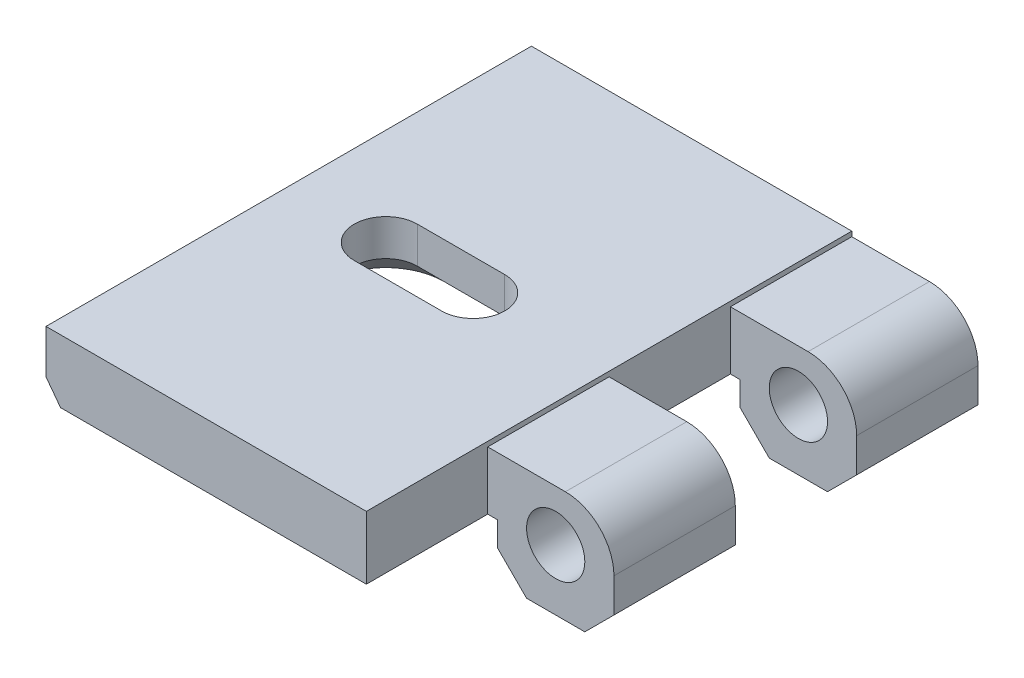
ISO-10303-21;
HEADER;
FILE_DESCRIPTION(('STEP AP214'),'2;1');
FILE_NAME('part.step','',(''),(''),'','','');
FILE_SCHEMA(('AUTOMOTIVE_DESIGN { 1 0 10303 214 1 1 1 1 }'));
ENDSEC;
DATA;
#1=APPLICATION_CONTEXT('core data for automotive mechanical design processes');
#2=APPLICATION_PROTOCOL_DEFINITION('international standard','automotive_design',2000,#1);
#3=PRODUCT_CONTEXT('',#1,'mechanical');
#4=PRODUCT('Part','Part','',(#3));
#5=PRODUCT_RELATED_PRODUCT_CATEGORY('part','',(#4));
#6=PRODUCT_DEFINITION_FORMATION('','',#4);
#7=PRODUCT_DEFINITION_CONTEXT('part definition',#1,'design');
#8=PRODUCT_DEFINITION('design','',#6,#7);
#9=PRODUCT_DEFINITION_SHAPE('','',#8);
#10=(LENGTH_UNIT() NAMED_UNIT(*) SI_UNIT(.MILLI.,.METRE.));
#11=(NAMED_UNIT(*) PLANE_ANGLE_UNIT() SI_UNIT($,.RADIAN.));
#12=(NAMED_UNIT(*) SI_UNIT($,.STERADIAN.) SOLID_ANGLE_UNIT());
#13=UNCERTAINTY_MEASURE_WITH_UNIT(LENGTH_MEASURE(1.E-05),#10,'distance_accuracy_value','');
#14=(GEOMETRIC_REPRESENTATION_CONTEXT(3) GLOBAL_UNCERTAINTY_ASSIGNED_CONTEXT((#13)) GLOBAL_UNIT_ASSIGNED_CONTEXT((#10,
#11,#12)) REPRESENTATION_CONTEXT('',''));
#15=CARTESIAN_POINT('',(0.,0.,0.));
#16=DIRECTION('',(0.,0.,1.));
#17=DIRECTION('',(1.,0.,0.));
#18=AXIS2_PLACEMENT_3D('',#15,#16,#17);
#19=CARTESIAN_POINT('',(-23.5,-12.,0.));
#20=DIRECTION('',(-0.707106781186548,-0.707106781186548,0.));
#21=DIRECTION('',(0.707106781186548,-0.707106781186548,0.));
#22=AXIS2_PLACEMENT_3D('',#19,#20,#21);
#23=PLANE('',#22);
#24=DIRECTION('',(0.707106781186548,-0.707106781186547,0.));
#25=VECTOR('',#24,1.);
#26=CARTESIAN_POINT('',(-26.5,-9.,0.));
#27=LINE('',#26,#25);
#28=CARTESIAN_POINT('',(-26.5,-9.,0.));
#29=VERTEX_POINT('',#28);
#30=CARTESIAN_POINT('',(-23.5,-12.,0.));
#31=VERTEX_POINT('',#30);
#32=EDGE_CURVE('E114',#29,#31,#27,.T.);
#33=ORIENTED_EDGE('',*,*,#32,.T.);
#34=DIRECTION('',(0.,0.,-1.));
#35=VECTOR('',#34,1.);
#36=CARTESIAN_POINT('',(-23.5,-12.,0.));
#37=LINE('',#36,#35);
#38=CARTESIAN_POINT('',(-23.5,-12.,12.5));
#39=VERTEX_POINT('',#38);
#40=EDGE_CURVE('E421',#39,#31,#37,.T.);
#41=ORIENTED_EDGE('',*,*,#40,.F.);
#42=DIRECTION('',(0.707106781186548,-0.707106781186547,0.));
#43=VECTOR('',#42,1.);
#44=CARTESIAN_POINT('',(-26.5,-9.,12.5));
#45=LINE('',#44,#43);
#46=CARTESIAN_POINT('',(-26.5,-9.,12.5));
#47=VERTEX_POINT('',#46);
#48=EDGE_CURVE('E407',#47,#39,#45,.T.);
#49=ORIENTED_EDGE('',*,*,#48,.F.);
#50=DIRECTION('',(0.,0.,1.));
#51=VECTOR('',#50,1.);
#52=CARTESIAN_POINT('',(-26.5,-9.,0.));
#53=LINE('',#52,#51);
#54=EDGE_CURVE('E118',#29,#47,#53,.T.);
#55=ORIENTED_EDGE('',*,*,#54,.F.);
#56=EDGE_LOOP('',(#33,#41,#49,#55));
#57=FACE_BOUND('',#56,.T.);
#58=ADVANCED_FACE('F15',(#57),#23,.T.);
#59=CARTESIAN_POINT('',(-17.5,-12.,0.));
#60=DIRECTION('',(0.,-1.,0.));
#61=DIRECTION('',(0.,0.,-1.));
#62=AXIS2_PLACEMENT_3D('',#59,#60,#61);
#63=PLANE('',#62);
#64=DIRECTION('',(1.,0.,0.));
#65=VECTOR('',#64,1.);
#66=CARTESIAN_POINT('',(-21.2886728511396,-12.,0.));
#67=LINE('',#66,#65);
#68=CARTESIAN_POINT('',(-17.5,-12.,0.));
#69=VERTEX_POINT('',#68);
#70=EDGE_CURVE('E418',#31,#69,#67,.T.);
#71=ORIENTED_EDGE('',*,*,#70,.T.);
#72=DIRECTION('',(0.,0.,1.));
#73=VECTOR('',#72,1.);
#74=CARTESIAN_POINT('',(-17.5,-12.,0.));
#75=LINE('',#74,#73);
#76=CARTESIAN_POINT('',(-17.5,-12.,12.5));
#77=VERTEX_POINT('',#76);
#78=EDGE_CURVE('E416',#77,#69,#75,.F.);
#79=ORIENTED_EDGE('',*,*,#78,.F.);
#80=DIRECTION('',(1.,0.,0.));
#81=VECTOR('',#80,1.);
#82=CARTESIAN_POINT('',(-21.2886728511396,-12.,12.5));
#83=LINE('',#82,#81);
#84=EDGE_CURVE('E428',#39,#77,#83,.T.);
#85=ORIENTED_EDGE('',*,*,#84,.F.);
#86=ORIENTED_EDGE('',*,*,#40,.T.);
#87=EDGE_LOOP('',(#71,#79,#85,#86));
#88=FACE_BOUND('',#87,.T.);
#89=ADVANCED_FACE('F475',(#88),#63,.T.);
#90=CARTESIAN_POINT('',(-14.5,-9.,0.));
#91=DIRECTION('',(0.707106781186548,-0.707106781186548,0.));
#92=DIRECTION('',(0.707106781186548,0.707106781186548,0.));
#93=AXIS2_PLACEMENT_3D('',#90,#91,#92);
#94=PLANE('',#93);
#95=DIRECTION('',(0.707106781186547,0.707106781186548,0.));
#96=VECTOR('',#95,1.);
#97=CARTESIAN_POINT('',(-17.5,-12.,0.));
#98=LINE('',#97,#96);
#99=CARTESIAN_POINT('',(-14.5,-9.,0.));
#100=VERTEX_POINT('',#99);
#101=EDGE_CURVE('E366',#69,#100,#98,.T.);
#102=ORIENTED_EDGE('',*,*,#101,.T.);
#103=DIRECTION('',(0.,0.,-1.));
#104=VECTOR('',#103,1.);
#105=CARTESIAN_POINT('',(-14.5,-9.,0.));
#106=LINE('',#105,#104);
#107=CARTESIAN_POINT('',(-14.5,-9.,12.5));
#108=VERTEX_POINT('',#107);
#109=EDGE_CURVE('E100',#108,#100,#106,.T.);
#110=ORIENTED_EDGE('',*,*,#109,.F.);
#111=DIRECTION('',(0.707106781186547,0.707106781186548,0.));
#112=VECTOR('',#111,1.);
#113=CARTESIAN_POINT('',(-17.5,-12.,12.5));
#114=LINE('',#113,#112);
#115=EDGE_CURVE('E381',#77,#108,#114,.T.);
#116=ORIENTED_EDGE('',*,*,#115,.F.);
#117=ORIENTED_EDGE('',*,*,#78,.T.);
#118=EDGE_LOOP('',(#102,#110,#116,#117));
#119=FACE_BOUND('',#118,.T.);
#120=ADVANCED_FACE('F477',(#119),#94,.T.);
#121=CARTESIAN_POINT('',(-14.5,-5.5,0.));
#122=DIRECTION('',(1.,0.,0.));
#123=DIRECTION('',(0.,0.,-1.));
#124=AXIS2_PLACEMENT_3D('',#121,#122,#123);
#125=PLANE('',#124);
#126=DIRECTION('',(0.,1.,0.));
#127=VECTOR('',#126,1.);
#128=CARTESIAN_POINT('',(-14.5,-5.90865689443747,0.));
#129=LINE('',#128,#127);
#130=CARTESIAN_POINT('',(-14.5,-5.5,0.));
#131=VERTEX_POINT('',#130);
#132=EDGE_CURVE('E364',#100,#131,#129,.T.);
#133=ORIENTED_EDGE('',*,*,#132,.T.);
#134=DIRECTION('',(0.,0.,1.));
#135=VECTOR('',#134,1.);
#136=CARTESIAN_POINT('',(-14.5,-5.5,0.));
#137=LINE('',#136,#135);
#138=CARTESIAN_POINT('',(-14.5,-5.5,12.5));
#139=VERTEX_POINT('',#138);
#140=EDGE_CURVE('E89',#139,#131,#137,.F.);
#141=ORIENTED_EDGE('',*,*,#140,.F.);
#142=DIRECTION('',(0.,1.,0.));
#143=VECTOR('',#142,1.);
#144=CARTESIAN_POINT('',(-14.5,-5.90865689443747,12.5));
#145=LINE('',#144,#143);
#146=EDGE_CURVE('E378',#108,#139,#145,.T.);
#147=ORIENTED_EDGE('',*,*,#146,.F.);
#148=ORIENTED_EDGE('',*,*,#109,.T.);
#149=EDGE_LOOP('',(#133,#141,#147,#148));
#150=FACE_BOUND('',#149,.T.);
#151=ADVANCED_FACE('F479',(#150),#125,.T.);
#152=CARTESIAN_POINT('',(-19.5,-5.5,0.));
#153=DIRECTION('',(0.,0.,1.));
#154=DIRECTION('',(1.,0.,0.));
#155=AXIS2_PLACEMENT_3D('',#152,#153,#154);
#156=CYLINDRICAL_SURFACE('',#155,5.);
#157=CARTESIAN_POINT('',(-19.5,-5.5,0.));
#158=DIRECTION('',(0.,0.,1.));
#159=DIRECTION('',(1.,0.,0.));
#160=AXIS2_PLACEMENT_3D('',#157,#158,#159);
#161=CIRCLE('',#160,5.);
#162=CARTESIAN_POINT('',(-19.5,-0.5,0.));
#163=VERTEX_POINT('',#162);
#164=EDGE_CURVE('E363',#131,#163,#161,.T.);
#165=ORIENTED_EDGE('',*,*,#164,.T.);
#166=DIRECTION('',(0.,0.,1.));
#167=VECTOR('',#166,1.);
#168=CARTESIAN_POINT('',(-19.5,-0.5,0.));
#169=LINE('',#168,#167);
#170=CARTESIAN_POINT('',(-19.5,-0.5,12.5));
#171=VERTEX_POINT('',#170);
#172=EDGE_CURVE('E373',#171,#163,#169,.F.);
#173=ORIENTED_EDGE('',*,*,#172,.F.);
#174=CARTESIAN_POINT('',(-19.5,-5.5,12.5));
#175=DIRECTION('',(0.,0.,1.));
#176=DIRECTION('',(1.,0.,0.));
#177=AXIS2_PLACEMENT_3D('',#174,#175,#176);
#178=CIRCLE('',#177,5.);
#179=EDGE_CURVE('E18',#139,#171,#178,.T.);
#180=ORIENTED_EDGE('',*,*,#179,.F.);
#181=ORIENTED_EDGE('',*,*,#140,.T.);
#182=EDGE_LOOP('',(#165,#173,#180,#181));
#183=FACE_BOUND('',#182,.T.);
#184=ADVANCED_FACE('F455',(#183),#156,.T.);
#185=CARTESIAN_POINT('',(-20.5,-5.75,0.));
#186=DIRECTION('',(0.,0.,1.));
#187=DIRECTION('',(1.,0.,0.));
#188=AXIS2_PLACEMENT_3D('',#185,#186,#187);
#189=CYLINDRICAL_SURFACE('',#188,3.);
#190=CARTESIAN_POINT('',(-20.5,-5.75,0.));
#191=DIRECTION('',(0.,0.,1.));
#192=DIRECTION('',(1.,0.,0.));
#193=AXIS2_PLACEMENT_3D('',#190,#191,#192);
#194=CIRCLE('',#193,3.);
#195=CARTESIAN_POINT('',(-17.5,-5.75,0.));
#196=VERTEX_POINT('',#195);
#197=EDGE_CURVE('E354',#196,#196,#194,.F.);
#198=ORIENTED_EDGE('',*,*,#197,.T.);
#199=EDGE_LOOP('',(#198));
#200=FACE_BOUND('',#199,.T.);
#201=CARTESIAN_POINT('',(-20.5,-5.75,12.5));
#202=DIRECTION('',(0.,0.,1.));
#203=DIRECTION('',(1.,0.,0.));
#204=AXIS2_PLACEMENT_3D('',#201,#202,#203);
#205=CIRCLE('',#204,3.);
#206=CARTESIAN_POINT('',(-17.5,-5.75,12.5));
#207=VERTEX_POINT('',#206);
#208=EDGE_CURVE('E374',#207,#207,#205,.F.);
#209=ORIENTED_EDGE('',*,*,#208,.F.);
#210=EDGE_LOOP('',(#209));
#211=FACE_BOUND('',#210,.T.);
#212=ADVANCED_FACE('F589',(#200,#211),#189,.F.);
#213=CARTESIAN_POINT('',(-26.5,-9.,0.));
#214=DIRECTION('',(-1.,0.,0.));
#215=DIRECTION('',(0.,0.,1.));
#216=AXIS2_PLACEMENT_3D('',#213,#214,#215);
#217=PLANE('',#216);
#218=DIRECTION('',(0.,1.,0.));
#219=VECTOR('',#218,1.);
#220=CARTESIAN_POINT('',(-26.5,-5.90865689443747,0.));
#221=LINE('',#220,#219);
#222=CARTESIAN_POINT('',(-26.5,-6.5,0.));
#223=VERTEX_POINT('',#222);
#224=EDGE_CURVE('E410',#223,#29,#221,.F.);
#225=ORIENTED_EDGE('',*,*,#224,.T.);
#226=ORIENTED_EDGE('',*,*,#54,.T.);
#227=DIRECTION('',(0.,1.,0.));
#228=VECTOR('',#227,1.);
#229=CARTESIAN_POINT('',(-26.5,-5.90865689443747,12.5));
#230=LINE('',#229,#228);
#231=CARTESIAN_POINT('',(-26.5,-6.5,12.5));
#232=VERTEX_POINT('',#231);
#233=EDGE_CURVE('E404',#232,#47,#230,.F.);
#234=ORIENTED_EDGE('',*,*,#233,.F.);
#235=DIRECTION('',(0.,0.,-1.));
#236=VECTOR('',#235,1.);
#237=CARTESIAN_POINT('',(-26.5,-6.5,-25.));
#238=LINE('',#237,#236);
#239=EDGE_CURVE('E357',#223,#232,#238,.F.);
#240=ORIENTED_EDGE('',*,*,#239,.F.);
#241=EDGE_LOOP('',(#225,#226,#234,#240));
#242=FACE_BOUND('',#241,.T.);
#243=ADVANCED_FACE('F471',(#242),#217,.T.);
#244=CARTESIAN_POINT('',(-21.2886728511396,-5.90865689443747,12.5));
#245=DIRECTION('',(0.,0.,1.));
#246=DIRECTION('',(1.,0.,0.));
#247=AXIS2_PLACEMENT_3D('',#244,#245,#246);
#248=PLANE('',#247);
#249=ORIENTED_EDGE('',*,*,#208,.T.);
#250=EDGE_LOOP('',(#249));
#251=FACE_BOUND('',#250,.T.);
#252=ORIENTED_EDGE('',*,*,#146,.T.);
#253=ORIENTED_EDGE('',*,*,#179,.T.);
#254=DIRECTION('',(1.,0.,0.));
#255=VECTOR('',#254,1.);
#256=CARTESIAN_POINT('',(-20.5,-0.5,12.5));
#257=LINE('',#256,#255);
#258=CARTESIAN_POINT('',(-27.5,-0.5,12.5));
#259=VERTEX_POINT('',#258);
#260=EDGE_CURVE('E370',#259,#171,#257,.T.);
#261=ORIENTED_EDGE('',*,*,#260,.F.);
#262=DIRECTION('',(0.,1.,0.));
#263=VECTOR('',#262,1.);
#264=CARTESIAN_POINT('',(-27.5,0.,12.5));
#265=LINE('',#264,#263);
#266=CARTESIAN_POINT('',(-27.5,-6.5,12.5));
#267=VERTEX_POINT('',#266);
#268=EDGE_CURVE('E369',#267,#259,#265,.T.);
#269=ORIENTED_EDGE('',*,*,#268,.F.);
#270=DIRECTION('',(1.,0.,0.));
#271=VECTOR('',#270,1.);
#272=CARTESIAN_POINT('',(-27.5,-6.5,12.5));
#273=LINE('',#272,#271);
#274=EDGE_CURVE('E382',#232,#267,#273,.F.);
#275=ORIENTED_EDGE('',*,*,#274,.F.);
#276=ORIENTED_EDGE('',*,*,#233,.T.);
#277=ORIENTED_EDGE('',*,*,#48,.T.);
#278=ORIENTED_EDGE('',*,*,#84,.T.);
#279=ORIENTED_EDGE('',*,*,#115,.T.);
#280=EDGE_LOOP('',(#252,#253,#261,#269,#275,#276,#277,#278,#279));
#281=FACE_BOUND('',#280,.T.);
#282=ADVANCED_FACE('F452',(#251,#281),#248,.T.);
#283=CARTESIAN_POINT('',(-20.5,-0.5,0.));
#284=DIRECTION('',(0.,1.,0.));
#285=DIRECTION('',(0.,0.,1.));
#286=AXIS2_PLACEMENT_3D('',#283,#284,#285);
#287=PLANE('',#286);
#288=DIRECTION('',(1.,0.,0.));
#289=VECTOR('',#288,1.);
#290=CARTESIAN_POINT('',(-21.2886728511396,-0.5,0.));
#291=LINE('',#290,#289);
#292=CARTESIAN_POINT('',(-27.5,-0.5,0.));
#293=VERTEX_POINT('',#292);
#294=EDGE_CURVE('E361',#163,#293,#291,.F.);
#295=ORIENTED_EDGE('',*,*,#294,.T.);
#296=DIRECTION('',(0.,0.,-1.));
#297=VECTOR('',#296,1.);
#298=CARTESIAN_POINT('',(-27.5,-0.5,-25.));
#299=LINE('',#298,#297);
#300=EDGE_CURVE('E360',#259,#293,#299,.T.);
#301=ORIENTED_EDGE('',*,*,#300,.F.);
#302=ORIENTED_EDGE('',*,*,#260,.T.);
#303=ORIENTED_EDGE('',*,*,#172,.T.);
#304=EDGE_LOOP('',(#295,#301,#302,#303));
#305=FACE_BOUND('',#304,.T.);
#306=ADVANCED_FACE('F459',(#305),#287,.T.);
#307=CARTESIAN_POINT('',(-21.2886728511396,-5.90865689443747,0.));
#308=DIRECTION('',(0.,0.,1.));
#309=DIRECTION('',(1.,0.,0.));
#310=AXIS2_PLACEMENT_3D('',#307,#308,#309);
#311=PLANE('',#310);
#312=ORIENTED_EDGE('',*,*,#197,.F.);
#313=EDGE_LOOP('',(#312));
#314=FACE_BOUND('',#313,.T.);
#315=ORIENTED_EDGE('',*,*,#164,.F.);
#316=ORIENTED_EDGE('',*,*,#132,.F.);
#317=ORIENTED_EDGE('',*,*,#101,.F.);
#318=ORIENTED_EDGE('',*,*,#70,.F.);
#319=ORIENTED_EDGE('',*,*,#32,.F.);
#320=ORIENTED_EDGE('',*,*,#224,.F.);
#321=DIRECTION('',(1.,0.,0.));
#322=VECTOR('',#321,1.);
#323=CARTESIAN_POINT('',(-27.5,-6.5,0.));
#324=LINE('',#323,#322);
#325=CARTESIAN_POINT('',(-27.5,-6.5,0.));
#326=VERTEX_POINT('',#325);
#327=EDGE_CURVE('E353',#326,#223,#324,.T.);
#328=ORIENTED_EDGE('',*,*,#327,.F.);
#329=DIRECTION('',(0.,1.,0.));
#330=VECTOR('',#329,1.);
#331=CARTESIAN_POINT('',(-27.5,0.,0.));
#332=LINE('',#331,#330);
#333=EDGE_CURVE('E350',#293,#326,#332,.F.);
#334=ORIENTED_EDGE('',*,*,#333,.F.);
#335=ORIENTED_EDGE('',*,*,#294,.F.);
#336=EDGE_LOOP('',(#315,#316,#317,#318,#319,#320,#328,#334,#335));
#337=FACE_BOUND('',#336,.T.);
#338=ADVANCED_FACE('F578',(#314,#337),#311,.F.);
#339=CARTESIAN_POINT('',(-21.2886728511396,-5.90865689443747,-12.5));
#340=DIRECTION('',(0.,0.,1.));
#341=DIRECTION('',(1.,0.,0.));
#342=AXIS2_PLACEMENT_3D('',#339,#340,#341);
#343=PLANE('',#342);
#344=CARTESIAN_POINT('',(-20.5,-5.75,-12.5));
#345=DIRECTION('',(0.,0.,1.));
#346=DIRECTION('',(1.,0.,0.));
#347=AXIS2_PLACEMENT_3D('',#344,#345,#346);
#348=CIRCLE('',#347,3.);
#349=CARTESIAN_POINT('',(-17.5,-5.75,-12.5));
#350=VERTEX_POINT('',#349);
#351=EDGE_CURVE('E300',#350,#350,#348,.F.);
#352=ORIENTED_EDGE('',*,*,#351,.T.);
#353=EDGE_LOOP('',(#352));
#354=FACE_BOUND('',#353,.T.);
#355=DIRECTION('',(0.,1.,0.));
#356=VECTOR('',#355,1.);
#357=CARTESIAN_POINT('',(-14.5,-5.5,-12.5));
#358=LINE('',#357,#356);
#359=CARTESIAN_POINT('',(-14.5,-5.5,-12.5));
#360=VERTEX_POINT('',#359);
#361=CARTESIAN_POINT('',(-14.5,-9.,-12.5));
#362=VERTEX_POINT('',#361);
#363=EDGE_CURVE('E313',#360,#362,#358,.F.);
#364=ORIENTED_EDGE('',*,*,#363,.F.);
#365=CARTESIAN_POINT('',(-19.5,-5.5,-12.5));
#366=DIRECTION('',(0.,0.,1.));
#367=DIRECTION('',(1.,0.,0.));
#368=AXIS2_PLACEMENT_3D('',#365,#366,#367);
#369=CIRCLE('',#368,5.);
#370=CARTESIAN_POINT('',(-19.5,-0.5,-12.5));
#371=VERTEX_POINT('',#370);
#372=EDGE_CURVE('E309',#371,#360,#369,.F.);
#373=ORIENTED_EDGE('',*,*,#372,.F.);
#374=DIRECTION('',(1.,0.,0.));
#375=VECTOR('',#374,1.);
#376=CARTESIAN_POINT('',(-20.5,-0.5,-12.5));
#377=LINE('',#376,#375);
#378=CARTESIAN_POINT('',(-27.5,-0.5,-12.5));
#379=VERTEX_POINT('',#378);
#380=EDGE_CURVE('E301',#379,#371,#377,.T.);
#381=ORIENTED_EDGE('',*,*,#380,.F.);
#382=DIRECTION('',(0.,1.,0.));
#383=VECTOR('',#382,1.);
#384=CARTESIAN_POINT('',(-27.5,0.,-12.5));
#385=LINE('',#384,#383);
#386=CARTESIAN_POINT('',(-27.5,-6.5,-12.5));
#387=VERTEX_POINT('',#386);
#388=EDGE_CURVE('E304',#387,#379,#385,.T.);
#389=ORIENTED_EDGE('',*,*,#388,.F.);
#390=DIRECTION('',(1.,0.,0.));
#391=VECTOR('',#390,1.);
#392=CARTESIAN_POINT('',(-27.5,-6.5,-12.5));
#393=LINE('',#392,#391);
#394=CARTESIAN_POINT('',(-26.5,-6.5,-12.5));
#395=VERTEX_POINT('',#394);
#396=EDGE_CURVE('E351',#395,#387,#393,.F.);
#397=ORIENTED_EDGE('',*,*,#396,.F.);
#398=DIRECTION('',(0.,1.,0.));
#399=VECTOR('',#398,1.);
#400=CARTESIAN_POINT('',(-26.5,-9.,-12.5));
#401=LINE('',#400,#399);
#402=CARTESIAN_POINT('',(-26.5,-9.,-12.5));
#403=VERTEX_POINT('',#402);
#404=EDGE_CURVE('E337',#403,#395,#401,.T.);
#405=ORIENTED_EDGE('',*,*,#404,.F.);
#406=DIRECTION('',(0.707106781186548,-0.707106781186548,0.));
#407=VECTOR('',#406,1.);
#408=CARTESIAN_POINT('',(-23.5,-12.,-12.5));
#409=LINE('',#408,#407);
#410=CARTESIAN_POINT('',(-23.5,-12.,-12.5));
#411=VERTEX_POINT('',#410);
#412=EDGE_CURVE('E331',#411,#403,#409,.F.);
#413=ORIENTED_EDGE('',*,*,#412,.F.);
#414=DIRECTION('',(1.,0.,0.));
#415=VECTOR('',#414,1.);
#416=CARTESIAN_POINT('',(-17.5,-12.,-12.5));
#417=LINE('',#416,#415);
#418=CARTESIAN_POINT('',(-17.5,-12.,-12.5));
#419=VERTEX_POINT('',#418);
#420=EDGE_CURVE('E325',#419,#411,#417,.F.);
#421=ORIENTED_EDGE('',*,*,#420,.F.);
#422=DIRECTION('',(0.707106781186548,0.707106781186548,0.));
#423=VECTOR('',#422,1.);
#424=CARTESIAN_POINT('',(-14.5,-9.,-12.5));
#425=LINE('',#424,#423);
#426=EDGE_CURVE('E319',#362,#419,#425,.F.);
#427=ORIENTED_EDGE('',*,*,#426,.F.);
#428=EDGE_LOOP('',(#364,#373,#381,#389,#397,#405,#413,#421,#427));
#429=FACE_BOUND('',#428,.T.);
#430=ADVANCED_FACE('F574',(#354,#429),#343,.T.);
#431=CARTESIAN_POINT('',(-27.5,-6.5,-25.));
#432=DIRECTION('',(0.,-1.,0.));
#433=DIRECTION('',(0.,0.,-1.));
#434=AXIS2_PLACEMENT_3D('',#431,#432,#433);
#435=PLANE('',#434);
#436=DIRECTION('',(1.,0.,0.));
#437=VECTOR('',#436,1.);
#438=CARTESIAN_POINT('',(-39.,-6.5,-6.));
#439=LINE('',#438,#437);
#440=CARTESIAN_POINT('',(-50.5,-6.50000000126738,-5.99999999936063));
#441=VERTEX_POINT('',#440);
#442=CARTESIAN_POINT('',(-41.5,-6.50000000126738,-5.99999999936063));
#443=VERTEX_POINT('',#442);
#444=EDGE_CURVE('E342',#441,#443,#439,.T.);
#445=ORIENTED_EDGE('',*,*,#444,.F.);
#446=CARTESIAN_POINT('',(-50.5,-6.50000000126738,0.));
#447=DIRECTION('',(0.,-1.,0.));
#448=DIRECTION('',(1.,0.,0.));
#449=AXIS2_PLACEMENT_3D('',#446,#447,#448);
#450=CIRCLE('',#449,5.99999999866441);
#451=CARTESIAN_POINT('',(-50.5,-6.50000000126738,5.99999999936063));
#452=VERTEX_POINT('',#451);
#453=EDGE_CURVE('E287',#441,#452,#450,.F.);
#454=ORIENTED_EDGE('',*,*,#453,.T.);
#455=DIRECTION('',(1.,0.,0.));
#456=VECTOR('',#455,1.);
#457=CARTESIAN_POINT('',(-34.5,-6.5,6.));
#458=LINE('',#457,#456);
#459=CARTESIAN_POINT('',(-41.5,-6.50000000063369,6.00000000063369));
#460=VERTEX_POINT('',#459);
#461=EDGE_CURVE('E291',#460,#452,#458,.F.);
#462=ORIENTED_EDGE('',*,*,#461,.F.);
#463=CARTESIAN_POINT('',(-41.5,-6.50000000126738,0.));
#464=DIRECTION('',(0.,-1.,0.));
#465=DIRECTION('',(1.,0.,0.));
#466=AXIS2_PLACEMENT_3D('',#463,#464,#465);
#467=CIRCLE('',#466,5.99999999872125);
#468=EDGE_CURVE('E296',#460,#443,#467,.F.);
#469=ORIENTED_EDGE('',*,*,#468,.T.);
#470=EDGE_LOOP('',(#445,#454,#462,#469));
#471=FACE_BOUND('',#470,.T.);
#472=DIRECTION('',(0.,0.,-1.));
#473=VECTOR('',#472,1.);
#474=CARTESIAN_POINT('',(-27.5,-6.5,-25.));
#475=LINE('',#474,#473);
#476=CARTESIAN_POINT('',(-27.5,-6.5,25.));
#477=VERTEX_POINT('',#476);
#478=EDGE_CURVE('E274',#477,#267,#475,.T.);
#479=ORIENTED_EDGE('',*,*,#478,.F.);
#480=DIRECTION('',(1.,0.,0.));
#481=VECTOR('',#480,1.);
#482=CARTESIAN_POINT('',(-41.2608064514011,-6.50000000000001,25.));
#483=LINE('',#482,#481);
#484=CARTESIAN_POINT('',(-59.,-6.50000000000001,25.));
#485=VERTEX_POINT('',#484);
#486=EDGE_CURVE('E377',#485,#477,#483,.T.);
#487=ORIENTED_EDGE('',*,*,#486,.F.);
#488=DIRECTION('',(0.,0.,1.));
#489=VECTOR('',#488,1.);
#490=CARTESIAN_POINT('',(-59.,-6.50000000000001,-12.5));
#491=LINE('',#490,#489);
#492=CARTESIAN_POINT('',(-59.,-6.5,-25.));
#493=VERTEX_POINT('',#492);
#494=EDGE_CURVE('E340',#493,#485,#491,.T.);
#495=ORIENTED_EDGE('',*,*,#494,.F.);
#496=DIRECTION('',(1.,0.,0.));
#497=VECTOR('',#496,1.);
#498=CARTESIAN_POINT('',(-41.2608064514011,-6.5,-25.));
#499=LINE('',#498,#497);
#500=CARTESIAN_POINT('',(-26.5,-6.5,-25.));
#501=VERTEX_POINT('',#500);
#502=EDGE_CURVE('E333',#493,#501,#499,.T.);
#503=ORIENTED_EDGE('',*,*,#502,.T.);
#504=DIRECTION('',(0.,0.,1.));
#505=VECTOR('',#504,1.);
#506=CARTESIAN_POINT('',(-26.5,-6.5,-25.));
#507=LINE('',#506,#505);
#508=EDGE_CURVE('E334',#395,#501,#507,.F.);
#509=ORIENTED_EDGE('',*,*,#508,.F.);
#510=ORIENTED_EDGE('',*,*,#396,.T.);
#511=DIRECTION('',(0.,0.,-1.));
#512=VECTOR('',#511,1.);
#513=CARTESIAN_POINT('',(-27.5,-6.5,-25.));
#514=LINE('',#513,#512);
#515=EDGE_CURVE('E347',#326,#387,#514,.T.);
#516=ORIENTED_EDGE('',*,*,#515,.F.);
#517=ORIENTED_EDGE('',*,*,#327,.T.);
#518=ORIENTED_EDGE('',*,*,#239,.T.);
#519=ORIENTED_EDGE('',*,*,#274,.T.);
#520=EDGE_LOOP('',(#479,#487,#495,#503,#509,#510,#516,#517,#518,#519));
#521=FACE_BOUND('',#520,.T.);
#522=ADVANCED_FACE('F466',(#471,#521),#435,.T.);
#523=CARTESIAN_POINT('',(-26.5,-9.,-25.));
#524=DIRECTION('',(-1.,0.,0.));
#525=DIRECTION('',(0.,0.,1.));
#526=AXIS2_PLACEMENT_3D('',#523,#524,#525);
#527=PLANE('',#526);
#528=DIRECTION('',(0.,1.,0.));
#529=VECTOR('',#528,1.);
#530=CARTESIAN_POINT('',(-26.5,-3.19045468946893,-25.));
#531=LINE('',#530,#529);
#532=CARTESIAN_POINT('',(-26.5,-9.,-25.));
#533=VERTEX_POINT('',#532);
#534=EDGE_CURVE('E327',#501,#533,#531,.F.);
#535=ORIENTED_EDGE('',*,*,#534,.T.);
#536=DIRECTION('',(0.,0.,1.));
#537=VECTOR('',#536,1.);
#538=CARTESIAN_POINT('',(-26.5,-9.,-25.));
#539=LINE('',#538,#537);
#540=EDGE_CURVE('E328',#403,#533,#539,.F.);
#541=ORIENTED_EDGE('',*,*,#540,.F.);
#542=ORIENTED_EDGE('',*,*,#404,.T.);
#543=ORIENTED_EDGE('',*,*,#508,.T.);
#544=EDGE_LOOP('',(#535,#541,#542,#543));
#545=FACE_BOUND('',#544,.T.);
#546=ADVANCED_FACE('F567',(#545),#527,.T.);
#547=CARTESIAN_POINT('',(-23.5,-12.,-25.));
#548=DIRECTION('',(-0.707106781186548,-0.707106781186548,0.));
#549=DIRECTION('',(0.707106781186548,-0.707106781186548,0.));
#550=AXIS2_PLACEMENT_3D('',#547,#548,#549);
#551=PLANE('',#550);
#552=DIRECTION('',(0.707106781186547,-0.707106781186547,0.));
#553=VECTOR('',#552,1.);
#554=CARTESIAN_POINT('',(-26.5,-9.,-25.));
#555=LINE('',#554,#553);
#556=CARTESIAN_POINT('',(-23.5,-12.,-25.));
#557=VERTEX_POINT('',#556);
#558=EDGE_CURVE('E321',#533,#557,#555,.T.);
#559=ORIENTED_EDGE('',*,*,#558,.T.);
#560=DIRECTION('',(0.,0.,-1.));
#561=VECTOR('',#560,1.);
#562=CARTESIAN_POINT('',(-23.5,-12.,-25.));
#563=LINE('',#562,#561);
#564=EDGE_CURVE('E322',#411,#557,#563,.T.);
#565=ORIENTED_EDGE('',*,*,#564,.F.);
#566=ORIENTED_EDGE('',*,*,#412,.T.);
#567=ORIENTED_EDGE('',*,*,#540,.T.);
#568=EDGE_LOOP('',(#559,#565,#566,#567));
#569=FACE_BOUND('',#568,.T.);
#570=ADVANCED_FACE('F563',(#569),#551,.T.);
#571=CARTESIAN_POINT('',(-17.5,-12.,-25.));
#572=DIRECTION('',(0.,-1.,0.));
#573=DIRECTION('',(0.,0.,-1.));
#574=AXIS2_PLACEMENT_3D('',#571,#572,#573);
#575=PLANE('',#574);
#576=DIRECTION('',(1.,0.,0.));
#577=VECTOR('',#576,1.);
#578=CARTESIAN_POINT('',(-41.2608064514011,-12.,-25.));
#579=LINE('',#578,#577);
#580=CARTESIAN_POINT('',(-17.5,-12.,-25.));
#581=VERTEX_POINT('',#580);
#582=EDGE_CURVE('E315',#557,#581,#579,.T.);
#583=ORIENTED_EDGE('',*,*,#582,.T.);
#584=DIRECTION('',(0.,0.,1.));
#585=VECTOR('',#584,1.);
#586=CARTESIAN_POINT('',(-17.5,-12.,-25.));
#587=LINE('',#586,#585);
#588=EDGE_CURVE('E316',#419,#581,#587,.F.);
#589=ORIENTED_EDGE('',*,*,#588,.F.);
#590=ORIENTED_EDGE('',*,*,#420,.T.);
#591=ORIENTED_EDGE('',*,*,#564,.T.);
#592=EDGE_LOOP('',(#583,#589,#590,#591));
#593=FACE_BOUND('',#592,.T.);
#594=ADVANCED_FACE('F559',(#593),#575,.T.);
#595=CARTESIAN_POINT('',(-14.5,-9.,-25.));
#596=DIRECTION('',(0.707106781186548,-0.707106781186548,0.));
#597=DIRECTION('',(0.707106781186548,0.707106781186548,0.));
#598=AXIS2_PLACEMENT_3D('',#595,#596,#597);
#599=PLANE('',#598);
#600=DIRECTION('',(0.707106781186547,0.707106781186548,0.));
#601=VECTOR('',#600,1.);
#602=CARTESIAN_POINT('',(-17.5,-12.,-25.));
#603=LINE('',#602,#601);
#604=CARTESIAN_POINT('',(-14.5,-9.,-25.));
#605=VERTEX_POINT('',#604);
#606=EDGE_CURVE('E270',#581,#605,#603,.T.);
#607=ORIENTED_EDGE('',*,*,#606,.T.);
#608=DIRECTION('',(0.,0.,-1.));
#609=VECTOR('',#608,1.);
#610=CARTESIAN_POINT('',(-14.5,-9.,-25.));
#611=LINE('',#610,#609);
#612=EDGE_CURVE('E310',#362,#605,#611,.T.);
#613=ORIENTED_EDGE('',*,*,#612,.F.);
#614=ORIENTED_EDGE('',*,*,#426,.T.);
#615=ORIENTED_EDGE('',*,*,#588,.T.);
#616=EDGE_LOOP('',(#607,#613,#614,#615));
#617=FACE_BOUND('',#616,.T.);
#618=ADVANCED_FACE('F555',(#617),#599,.T.);
#619=CARTESIAN_POINT('',(-14.5,-5.5,-25.));
#620=DIRECTION('',(1.,0.,0.));
#621=DIRECTION('',(0.,0.,-1.));
#622=AXIS2_PLACEMENT_3D('',#619,#620,#621);
#623=PLANE('',#622);
#624=DIRECTION('',(0.,1.,0.));
#625=VECTOR('',#624,1.);
#626=CARTESIAN_POINT('',(-14.5,-3.19045468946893,-25.));
#627=LINE('',#626,#625);
#628=CARTESIAN_POINT('',(-14.5,-5.5,-25.));
#629=VERTEX_POINT('',#628);
#630=EDGE_CURVE('E268',#605,#629,#627,.T.);
#631=ORIENTED_EDGE('',*,*,#630,.T.);
#632=DIRECTION('',(0.,0.,1.));
#633=VECTOR('',#632,1.);
#634=CARTESIAN_POINT('',(-14.5,-5.5,-25.));
#635=LINE('',#634,#633);
#636=EDGE_CURVE('E306',#360,#629,#635,.F.);
#637=ORIENTED_EDGE('',*,*,#636,.F.);
#638=ORIENTED_EDGE('',*,*,#363,.T.);
#639=ORIENTED_EDGE('',*,*,#612,.T.);
#640=EDGE_LOOP('',(#631,#637,#638,#639));
#641=FACE_BOUND('',#640,.T.);
#642=ADVANCED_FACE('F551',(#641),#623,.T.);
#643=CARTESIAN_POINT('',(-19.5,-5.5,-25.));
#644=DIRECTION('',(0.,0.,1.));
#645=DIRECTION('',(1.,0.,0.));
#646=AXIS2_PLACEMENT_3D('',#643,#644,#645);
#647=CYLINDRICAL_SURFACE('',#646,5.);
#648=CARTESIAN_POINT('',(-19.5,-5.5,-25.));
#649=DIRECTION('',(0.,0.,1.));
#650=DIRECTION('',(1.,0.,0.));
#651=AXIS2_PLACEMENT_3D('',#648,#649,#650);
#652=CIRCLE('',#651,5.);
#653=CARTESIAN_POINT('',(-19.5,-0.5,-25.));
#654=VERTEX_POINT('',#653);
#655=EDGE_CURVE('E267',#629,#654,#652,.T.);
#656=ORIENTED_EDGE('',*,*,#655,.T.);
#657=DIRECTION('',(0.,0.,1.));
#658=VECTOR('',#657,1.);
#659=CARTESIAN_POINT('',(-19.5,-0.5,-25.));
#660=LINE('',#659,#658);
#661=EDGE_CURVE('E297',#371,#654,#660,.F.);
#662=ORIENTED_EDGE('',*,*,#661,.F.);
#663=ORIENTED_EDGE('',*,*,#372,.T.);
#664=ORIENTED_EDGE('',*,*,#636,.T.);
#665=EDGE_LOOP('',(#656,#662,#663,#664));
#666=FACE_BOUND('',#665,.T.);
#667=ADVANCED_FACE('F547',(#666),#647,.T.);
#668=CARTESIAN_POINT('',(-20.5,-0.5,-25.));
#669=DIRECTION('',(0.,1.,0.));
#670=DIRECTION('',(0.,0.,1.));
#671=AXIS2_PLACEMENT_3D('',#668,#669,#670);
#672=PLANE('',#671);
#673=DIRECTION('',(1.,0.,0.));
#674=VECTOR('',#673,1.);
#675=CARTESIAN_POINT('',(-41.2608064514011,-0.5,-25.));
#676=LINE('',#675,#674);
#677=CARTESIAN_POINT('',(-27.5,-0.5,-25.));
#678=VERTEX_POINT('',#677);
#679=EDGE_CURVE('E264',#654,#678,#676,.F.);
#680=ORIENTED_EDGE('',*,*,#679,.T.);
#681=DIRECTION('',(0.,0.,-1.));
#682=VECTOR('',#681,1.);
#683=CARTESIAN_POINT('',(-27.5,-0.5,-25.));
#684=LINE('',#683,#682);
#685=EDGE_CURVE('E275',#379,#678,#684,.T.);
#686=ORIENTED_EDGE('',*,*,#685,.F.);
#687=ORIENTED_EDGE('',*,*,#380,.T.);
#688=ORIENTED_EDGE('',*,*,#661,.T.);
#689=EDGE_LOOP('',(#680,#686,#687,#688));
#690=FACE_BOUND('',#689,.T.);
#691=ADVANCED_FACE('F543',(#690),#672,.T.);
#692=CARTESIAN_POINT('',(-20.5,-5.75,0.));
#693=DIRECTION('',(0.,0.,1.));
#694=DIRECTION('',(1.,0.,0.));
#695=AXIS2_PLACEMENT_3D('',#692,#693,#694);
#696=CYLINDRICAL_SURFACE('',#695,3.);
#697=ORIENTED_EDGE('',*,*,#351,.F.);
#698=EDGE_LOOP('',(#697));
#699=FACE_BOUND('',#698,.T.);
#700=CARTESIAN_POINT('',(-20.5,-5.75,-25.));
#701=DIRECTION('',(0.,0.,1.));
#702=DIRECTION('',(1.,0.,0.));
#703=AXIS2_PLACEMENT_3D('',#700,#701,#702);
#704=CIRCLE('',#703,3.);
#705=CARTESIAN_POINT('',(-17.5,-5.75,-25.));
#706=VERTEX_POINT('',#705);
#707=EDGE_CURVE('E229',#706,#706,#704,.F.);
#708=ORIENTED_EDGE('',*,*,#707,.T.);
#709=EDGE_LOOP('',(#708));
#710=FACE_BOUND('',#709,.T.);
#711=ADVANCED_FACE('F539',(#699,#710),#696,.F.);
#712=CARTESIAN_POINT('',(-59.75,-5.5,-12.5));
#713=DIRECTION('',(-0.799999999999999,-0.600000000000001,0.));
#714=DIRECTION('',(0.600000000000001,-0.799999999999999,0.));
#715=AXIS2_PLACEMENT_3D('',#712,#713,#714);
#716=PLANE('',#715);
#717=DIRECTION('',(0.6,-0.8,0.));
#718=VECTOR('',#717,1.);
#719=CARTESIAN_POINT('',(-60.5,-4.5,25.));
#720=LINE('',#719,#718);
#721=CARTESIAN_POINT('',(-60.5,-4.5,25.));
#722=VERTEX_POINT('',#721);
#723=EDGE_CURVE('E280',#722,#485,#720,.T.);
#724=ORIENTED_EDGE('',*,*,#723,.F.);
#725=DIRECTION('',(0.,0.,-1.));
#726=VECTOR('',#725,1.);
#727=CARTESIAN_POINT('',(-60.5,-4.5,0.));
#728=LINE('',#727,#726);
#729=CARTESIAN_POINT('',(-60.5,-4.5,-25.));
#730=VERTEX_POINT('',#729);
#731=EDGE_CURVE('E261',#722,#730,#728,.T.);
#732=ORIENTED_EDGE('',*,*,#731,.T.);
#733=DIRECTION('',(0.6,-0.8,0.));
#734=VECTOR('',#733,1.);
#735=CARTESIAN_POINT('',(-60.5,-4.5,-25.));
#736=LINE('',#735,#734);
#737=EDGE_CURVE('E224',#730,#493,#736,.T.);
#738=ORIENTED_EDGE('',*,*,#737,.T.);
#739=ORIENTED_EDGE('',*,*,#494,.T.);
#740=EDGE_LOOP('',(#724,#732,#738,#739));
#741=FACE_BOUND('',#740,.T.);
#742=ADVANCED_FACE('F535',(#741),#716,.T.);
#743=CARTESIAN_POINT('',(-39.,-5.125,-4.625));
#744=DIRECTION('',(0.,-0.707106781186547,0.707106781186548));
#745=DIRECTION('',(0.,-0.707106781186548,-0.707106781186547));
#746=AXIS2_PLACEMENT_3D('',#743,#744,#745);
#747=PLANE('',#746);
#748=DIRECTION('',(0.,0.70710678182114,0.707106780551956));
#749=VECTOR('',#748,1.);
#750=CARTESIAN_POINT('',(-41.5,-499000.,-498999.499104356));
#751=LINE('',#750,#749);
#752=CARTESIAN_POINT('',(-41.5,-3.7499999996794,-3.250000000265));
#753=VERTEX_POINT('',#752);
#754=EDGE_CURVE('E292',#443,#753,#751,.T.);
#755=ORIENTED_EDGE('',*,*,#754,.T.);
#756=DIRECTION('',(-1.,0.,0.));
#757=VECTOR('',#756,1.);
#758=CARTESIAN_POINT('',(-50.5,-3.75,-3.25));
#759=LINE('',#758,#757);
#760=CARTESIAN_POINT('',(-50.5,-3.74999999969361,-3.25000000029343));
#761=VERTEX_POINT('',#760);
#762=EDGE_CURVE('E260',#753,#761,#759,.T.);
#763=ORIENTED_EDGE('',*,*,#762,.T.);
#764=DIRECTION('',(0.,0.707106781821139,0.707106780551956));
#765=VECTOR('',#764,1.);
#766=CARTESIAN_POINT('',(-50.5000000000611,-499000.,-498999.499104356));
#767=LINE('',#766,#765);
#768=EDGE_CURVE('E277',#761,#441,#767,.F.);
#769=ORIENTED_EDGE('',*,*,#768,.T.);
#770=ORIENTED_EDGE('',*,*,#444,.T.);
#771=EDGE_LOOP('',(#755,#763,#769,#770));
#772=FACE_BOUND('',#771,.T.);
#773=ADVANCED_FACE('F531',(#772),#747,.T.);
#774=CARTESIAN_POINT('',(-41.5,-6.50000000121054,0.));
#775=DIRECTION('',(0.,-1.,0.));
#776=DIRECTION('',(1.,0.,0.));
#777=AXIS2_PLACEMENT_3D('',#774,#775,#776);
#778=CONICAL_SURFACE('',#777,5.99999999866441,0.785398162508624);
#779=ORIENTED_EDGE('',*,*,#468,.F.);
#780=DIRECTION('',(0.,0.707106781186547,-0.707106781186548));
#781=VECTOR('',#780,1.);
#782=CARTESIAN_POINT('',(-41.5,-5.125,4.625));
#783=LINE('',#782,#781);
#784=CARTESIAN_POINT('',(-41.5,-3.75,3.25));
#785=VERTEX_POINT('',#784);
#786=EDGE_CURVE('E288',#785,#460,#783,.F.);
#787=ORIENTED_EDGE('',*,*,#786,.F.);
#788=CARTESIAN_POINT('',(-41.5,-3.75,0.));
#789=DIRECTION('',(0.,1.,0.));
#790=DIRECTION('',(0.,0.,1.));
#791=AXIS2_PLACEMENT_3D('',#788,#789,#790);
#792=CIRCLE('',#791,3.25);
#793=EDGE_CURVE('E257',#785,#753,#792,.T.);
#794=ORIENTED_EDGE('',*,*,#793,.T.);
#795=ORIENTED_EDGE('',*,*,#754,.F.);
#796=EDGE_LOOP('',(#779,#787,#794,#795));
#797=FACE_BOUND('',#796,.T.);
#798=ADVANCED_FACE('F527',(#797),#778,.F.);
#799=CARTESIAN_POINT('',(-34.5,-5.125,4.625));
#800=DIRECTION('',(0.,-0.707106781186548,-0.707106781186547));
#801=DIRECTION('',(0.,0.707106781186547,-0.707106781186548));
#802=AXIS2_PLACEMENT_3D('',#799,#800,#801);
#803=PLANE('',#802);
#804=ORIENTED_EDGE('',*,*,#786,.T.);
#805=ORIENTED_EDGE('',*,*,#461,.T.);
#806=DIRECTION('',(0.,0.707106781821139,-0.707106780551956));
#807=VECTOR('',#806,1.);
#808=CARTESIAN_POINT('',(-50.5,-499000.,498999.499104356));
#809=LINE('',#808,#807);
#810=CARTESIAN_POINT('',(-50.5,-3.74999999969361,3.25000000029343));
#811=VERTEX_POINT('',#810);
#812=EDGE_CURVE('E281',#452,#811,#809,.T.);
#813=ORIENTED_EDGE('',*,*,#812,.T.);
#814=DIRECTION('',(1.,0.,0.));
#815=VECTOR('',#814,1.);
#816=CARTESIAN_POINT('',(-41.5,-3.75,3.25));
#817=LINE('',#816,#815);
#818=EDGE_CURVE('E252',#811,#785,#817,.T.);
#819=ORIENTED_EDGE('',*,*,#818,.T.);
#820=EDGE_LOOP('',(#804,#805,#813,#819));
#821=FACE_BOUND('',#820,.T.);
#822=ADVANCED_FACE('F523',(#821),#803,.T.);
#823=CARTESIAN_POINT('',(-50.5,-6.50000000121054,0.));
#824=DIRECTION('',(0.,-1.,0.));
#825=DIRECTION('',(1.,0.,0.));
#826=AXIS2_PLACEMENT_3D('',#823,#824,#825);
#827=CONICAL_SURFACE('',#826,5.99999999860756,0.785398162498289);
#828=CARTESIAN_POINT('',(-50.5,-3.75,0.));
#829=DIRECTION('',(0.,1.,0.));
#830=DIRECTION('',(0.,0.,1.));
#831=AXIS2_PLACEMENT_3D('',#828,#829,#830);
#832=CIRCLE('',#831,3.25);
#833=EDGE_CURVE('E249',#761,#811,#832,.T.);
#834=ORIENTED_EDGE('',*,*,#833,.T.);
#835=ORIENTED_EDGE('',*,*,#812,.F.);
#836=ORIENTED_EDGE('',*,*,#453,.F.);
#837=ORIENTED_EDGE('',*,*,#768,.F.);
#838=EDGE_LOOP('',(#834,#835,#836,#837));
#839=FACE_BOUND('',#838,.T.);
#840=ADVANCED_FACE('F519',(#839),#827,.F.);
#841=CARTESIAN_POINT('',(-41.2608064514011,-3.19045468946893,25.));
#842=DIRECTION('',(0.,0.,1.));
#843=DIRECTION('',(1.,0.,0.));
#844=AXIS2_PLACEMENT_3D('',#841,#842,#843);
#845=PLANE('',#844);
#846=DIRECTION('',(1.,0.,0.));
#847=VECTOR('',#846,1.);
#848=CARTESIAN_POINT('',(-55.5,0.,25.));
#849=LINE('',#848,#847);
#850=CARTESIAN_POINT('',(-60.5,0.,25.));
#851=VERTEX_POINT('',#850);
#852=CARTESIAN_POINT('',(-27.5,0.,25.));
#853=VERTEX_POINT('',#852);
#854=EDGE_CURVE('E244',#851,#853,#849,.T.);
#855=ORIENTED_EDGE('',*,*,#854,.F.);
#856=DIRECTION('',(0.,1.,0.));
#857=VECTOR('',#856,1.);
#858=CARTESIAN_POINT('',(-60.5,-3.25,25.));
#859=LINE('',#858,#857);
#860=EDGE_CURVE('E228',#851,#722,#859,.F.);
#861=ORIENTED_EDGE('',*,*,#860,.T.);
#862=ORIENTED_EDGE('',*,*,#723,.T.);
#863=ORIENTED_EDGE('',*,*,#486,.T.);
#864=DIRECTION('',(0.,1.,0.));
#865=VECTOR('',#864,1.);
#866=CARTESIAN_POINT('',(-27.5,0.,25.));
#867=LINE('',#866,#865);
#868=EDGE_CURVE('E271',#853,#477,#867,.F.);
#869=ORIENTED_EDGE('',*,*,#868,.F.);
#870=EDGE_LOOP('',(#855,#861,#862,#863,#869));
#871=FACE_BOUND('',#870,.T.);
#872=ADVANCED_FACE('F516',(#871),#845,.T.);
#873=CARTESIAN_POINT('',(-27.5,0.,-25.));
#874=DIRECTION('',(1.,0.,0.));
#875=DIRECTION('',(0.,0.,-1.));
#876=AXIS2_PLACEMENT_3D('',#873,#874,#875);
#877=PLANE('',#876);
#878=ORIENTED_EDGE('',*,*,#868,.T.);
#879=ORIENTED_EDGE('',*,*,#478,.T.);
#880=ORIENTED_EDGE('',*,*,#268,.T.);
#881=ORIENTED_EDGE('',*,*,#300,.T.);
#882=ORIENTED_EDGE('',*,*,#333,.T.);
#883=ORIENTED_EDGE('',*,*,#515,.T.);
#884=ORIENTED_EDGE('',*,*,#388,.T.);
#885=ORIENTED_EDGE('',*,*,#685,.T.);
#886=DIRECTION('',(0.,1.,0.));
#887=VECTOR('',#886,1.);
#888=CARTESIAN_POINT('',(-27.5,-3.19045468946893,-25.));
#889=LINE('',#888,#887);
#890=CARTESIAN_POINT('',(-27.5,0.,-25.));
#891=VERTEX_POINT('',#890);
#892=EDGE_CURVE('E266',#678,#891,#889,.T.);
#893=ORIENTED_EDGE('',*,*,#892,.T.);
#894=DIRECTION('',(0.,0.,1.));
#895=VECTOR('',#894,1.);
#896=CARTESIAN_POINT('',(-27.5,0.,-25.));
#897=LINE('',#896,#895);
#898=EDGE_CURVE('E242',#853,#891,#897,.F.);
#899=ORIENTED_EDGE('',*,*,#898,.F.);
#900=EDGE_LOOP('',(#878,#879,#880,#881,#882,#883,#884,#885,#893,#899));
#901=FACE_BOUND('',#900,.T.);
#902=ADVANCED_FACE('F462',(#901),#877,.T.);
#903=CARTESIAN_POINT('',(-41.2608064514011,-3.19045468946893,-25.));
#904=DIRECTION('',(0.,0.,1.));
#905=DIRECTION('',(1.,0.,0.));
#906=AXIS2_PLACEMENT_3D('',#903,#904,#905);
#907=PLANE('',#906);
#908=ORIENTED_EDGE('',*,*,#707,.F.);
#909=EDGE_LOOP('',(#908));
#910=FACE_BOUND('',#909,.T.);
#911=DIRECTION('',(0.,1.,0.));
#912=VECTOR('',#911,1.);
#913=CARTESIAN_POINT('',(-60.5,-3.25,-25.));
#914=LINE('',#913,#912);
#915=CARTESIAN_POINT('',(-60.5,0.,-25.));
#916=VERTEX_POINT('',#915);
#917=EDGE_CURVE('E215',#730,#916,#914,.T.);
#918=ORIENTED_EDGE('',*,*,#917,.T.);
#919=DIRECTION('',(1.,0.,0.));
#920=VECTOR('',#919,1.);
#921=CARTESIAN_POINT('',(-55.5,0.,-25.));
#922=LINE('',#921,#920);
#923=EDGE_CURVE('E220',#891,#916,#922,.F.);
#924=ORIENTED_EDGE('',*,*,#923,.F.);
#925=ORIENTED_EDGE('',*,*,#892,.F.);
#926=ORIENTED_EDGE('',*,*,#679,.F.);
#927=ORIENTED_EDGE('',*,*,#655,.F.);
#928=ORIENTED_EDGE('',*,*,#630,.F.);
#929=ORIENTED_EDGE('',*,*,#606,.F.);
#930=ORIENTED_EDGE('',*,*,#582,.F.);
#931=ORIENTED_EDGE('',*,*,#558,.F.);
#932=ORIENTED_EDGE('',*,*,#534,.F.);
#933=ORIENTED_EDGE('',*,*,#502,.F.);
#934=ORIENTED_EDGE('',*,*,#737,.F.);
#935=EDGE_LOOP('',(#918,#924,#925,#926,#927,#928,#929,#930,#931,#932,#933,#934));
#936=FACE_BOUND('',#935,.T.);
#937=ADVANCED_FACE('F217',(#910,#936),#907,.F.);
#938=CARTESIAN_POINT('',(-60.5,-3.25,0.));
#939=DIRECTION('',(1.,0.,0.));
#940=DIRECTION('',(0.,0.,-1.));
#941=AXIS2_PLACEMENT_3D('',#938,#939,#940);
#942=PLANE('',#941);
#943=ORIENTED_EDGE('',*,*,#860,.F.);
#944=DIRECTION('',(0.,0.,1.));
#945=VECTOR('',#944,1.);
#946=CARTESIAN_POINT('',(-60.5,0.,-25.));
#947=LINE('',#946,#945);
#948=EDGE_CURVE('E233',#916,#851,#947,.T.);
#949=ORIENTED_EDGE('',*,*,#948,.F.);
#950=ORIENTED_EDGE('',*,*,#917,.F.);
#951=ORIENTED_EDGE('',*,*,#731,.F.);
#952=EDGE_LOOP('',(#943,#949,#950,#951));
#953=FACE_BOUND('',#952,.T.);
#954=ADVANCED_FACE('F234',(#953),#942,.F.);
#955=CARTESIAN_POINT('',(-50.5,-6.5,-3.25));
#956=DIRECTION('',(0.,0.,-1.));
#957=DIRECTION('',(-1.,0.,0.));
#958=AXIS2_PLACEMENT_3D('',#955,#956,#957);
#959=PLANE('',#958);
#960=DIRECTION('',(0.,1.,0.));
#961=VECTOR('',#960,1.);
#962=CARTESIAN_POINT('',(-41.5,-6.5,-3.25));
#963=LINE('',#962,#961);
#964=CARTESIAN_POINT('',(-41.5,0.,-3.25));
#965=VERTEX_POINT('',#964);
#966=EDGE_CURVE('E258',#753,#965,#963,.T.);
#967=ORIENTED_EDGE('',*,*,#966,.T.);
#968=DIRECTION('',(1.,0.,0.));
#969=VECTOR('',#968,1.);
#970=CARTESIAN_POINT('',(-55.5,0.,-3.25));
#971=LINE('',#970,#969);
#972=CARTESIAN_POINT('',(-50.5,0.,-3.25));
#973=VERTEX_POINT('',#972);
#974=EDGE_CURVE('E238',#973,#965,#971,.T.);
#975=ORIENTED_EDGE('',*,*,#974,.F.);
#976=DIRECTION('',(0.,1.,0.));
#977=VECTOR('',#976,1.);
#978=CARTESIAN_POINT('',(-50.5,-6.5,-3.25));
#979=LINE('',#978,#977);
#980=EDGE_CURVE('E251',#973,#761,#979,.F.);
#981=ORIENTED_EDGE('',*,*,#980,.T.);
#982=ORIENTED_EDGE('',*,*,#762,.F.);
#983=EDGE_LOOP('',(#967,#975,#981,#982));
#984=FACE_BOUND('',#983,.T.);
#985=ADVANCED_FACE('F504',(#984),#959,.F.);
#986=CARTESIAN_POINT('',(-41.5,-6.5,0.));
#987=DIRECTION('',(0.,1.,0.));
#988=DIRECTION('',(0.,0.,1.));
#989=AXIS2_PLACEMENT_3D('',#986,#987,#988);
#990=CYLINDRICAL_SURFACE('',#989,3.25);
#991=DIRECTION('',(0.,1.,0.));
#992=VECTOR('',#991,1.);
#993=CARTESIAN_POINT('',(-41.5,-6.5,3.25));
#994=LINE('',#993,#992);
#995=CARTESIAN_POINT('',(-41.5,0.,3.25));
#996=VERTEX_POINT('',#995);
#997=EDGE_CURVE('E255',#785,#996,#994,.T.);
#998=ORIENTED_EDGE('',*,*,#997,.T.);
#999=CARTESIAN_POINT('',(-41.5,0.,0.));
#1000=DIRECTION('',(0.,1.,0.));
#1001=DIRECTION('',(0.,0.,1.));
#1002=AXIS2_PLACEMENT_3D('',#999,#1000,#1001);
#1003=CIRCLE('',#1002,3.25);
#1004=EDGE_CURVE('E433',#965,#996,#1003,.F.);
#1005=ORIENTED_EDGE('',*,*,#1004,.F.);
#1006=ORIENTED_EDGE('',*,*,#966,.F.);
#1007=ORIENTED_EDGE('',*,*,#793,.F.);
#1008=EDGE_LOOP('',(#998,#1005,#1006,#1007));
#1009=FACE_BOUND('',#1008,.T.);
#1010=ADVANCED_FACE('F501',(#1009),#990,.F.);
#1011=CARTESIAN_POINT('',(-41.5,-6.5,3.25));
#1012=DIRECTION('',(0.,0.,1.));
#1013=DIRECTION('',(1.,0.,0.));
#1014=AXIS2_PLACEMENT_3D('',#1011,#1012,#1013);
#1015=PLANE('',#1014);
#1016=DIRECTION('',(0.,1.,0.));
#1017=VECTOR('',#1016,1.);
#1018=CARTESIAN_POINT('',(-50.5,-6.5,3.25));
#1019=LINE('',#1018,#1017);
#1020=CARTESIAN_POINT('',(-50.5,0.,3.25));
#1021=VERTEX_POINT('',#1020);
#1022=EDGE_CURVE('E33',#811,#1021,#1019,.T.);
#1023=ORIENTED_EDGE('',*,*,#1022,.T.);
#1024=DIRECTION('',(1.,0.,0.));
#1025=VECTOR('',#1024,1.);
#1026=CARTESIAN_POINT('',(-55.5,0.,3.25));
#1027=LINE('',#1026,#1025);
#1028=EDGE_CURVE('E24',#996,#1021,#1027,.F.);
#1029=ORIENTED_EDGE('',*,*,#1028,.F.);
#1030=ORIENTED_EDGE('',*,*,#997,.F.);
#1031=ORIENTED_EDGE('',*,*,#818,.F.);
#1032=EDGE_LOOP('',(#1023,#1029,#1030,#1031));
#1033=FACE_BOUND('',#1032,.T.);
#1034=ADVANCED_FACE('F494',(#1033),#1015,.F.);
#1035=CARTESIAN_POINT('',(-50.5,-6.5,0.));
#1036=DIRECTION('',(0.,1.,0.));
#1037=DIRECTION('',(0.,0.,1.));
#1038=AXIS2_PLACEMENT_3D('',#1035,#1036,#1037);
#1039=CYLINDRICAL_SURFACE('',#1038,3.25);
#1040=ORIENTED_EDGE('',*,*,#980,.F.);
#1041=CARTESIAN_POINT('',(-50.5,0.,0.));
#1042=DIRECTION('',(0.,1.,0.));
#1043=DIRECTION('',(0.,0.,1.));
#1044=AXIS2_PLACEMENT_3D('',#1041,#1042,#1043);
#1045=CIRCLE('',#1044,3.25);
#1046=EDGE_CURVE('E10',#1021,#973,#1045,.F.);
#1047=ORIENTED_EDGE('',*,*,#1046,.F.);
#1048=ORIENTED_EDGE('',*,*,#1022,.F.);
#1049=ORIENTED_EDGE('',*,*,#833,.F.);
#1050=EDGE_LOOP('',(#1040,#1047,#1048,#1049));
#1051=FACE_BOUND('',#1050,.T.);
#1052=ADVANCED_FACE('F488',(#1051),#1039,.F.);
#1053=CARTESIAN_POINT('',(-55.5,0.,-25.));
#1054=DIRECTION('',(0.,1.,0.));
#1055=DIRECTION('',(0.,0.,1.));
#1056=AXIS2_PLACEMENT_3D('',#1053,#1054,#1055);
#1057=PLANE('',#1056);
#1058=ORIENTED_EDGE('',*,*,#1028,.T.);
#1059=ORIENTED_EDGE('',*,*,#1046,.T.);
#1060=ORIENTED_EDGE('',*,*,#974,.T.);
#1061=ORIENTED_EDGE('',*,*,#1004,.T.);
#1062=EDGE_LOOP('',(#1058,#1059,#1060,#1061));
#1063=FACE_BOUND('',#1062,.T.);
#1064=ORIENTED_EDGE('',*,*,#923,.T.);
#1065=ORIENTED_EDGE('',*,*,#948,.T.);
#1066=ORIENTED_EDGE('',*,*,#854,.T.);
#1067=ORIENTED_EDGE('',*,*,#898,.T.);
#1068=EDGE_LOOP('',(#1064,#1065,#1066,#1067));
#1069=FACE_BOUND('',#1068,.T.);
#1070=ADVANCED_FACE('F240',(#1063,#1069),#1057,.T.);
#1071=CLOSED_SHELL('',(#58,#89,#120,#151,#184,#212,#243,#282,#306,#338,#430,#522,#546,#570,#594,
#618,#642,#667,#691,#711,#742,#773,#798,#822,#840,#872,#902,#937,#954,#985,#1010,#1034,#1052,#1070));
#1072=MANIFOLD_SOLID_BREP('B1',#1071);
#1073=ADVANCED_BREP_SHAPE_REPRESENTATION('',(#18,#1072),#14);
#1074=SHAPE_DEFINITION_REPRESENTATION(#9,#1073);
ENDSEC;
END-ISO-10303-21;
